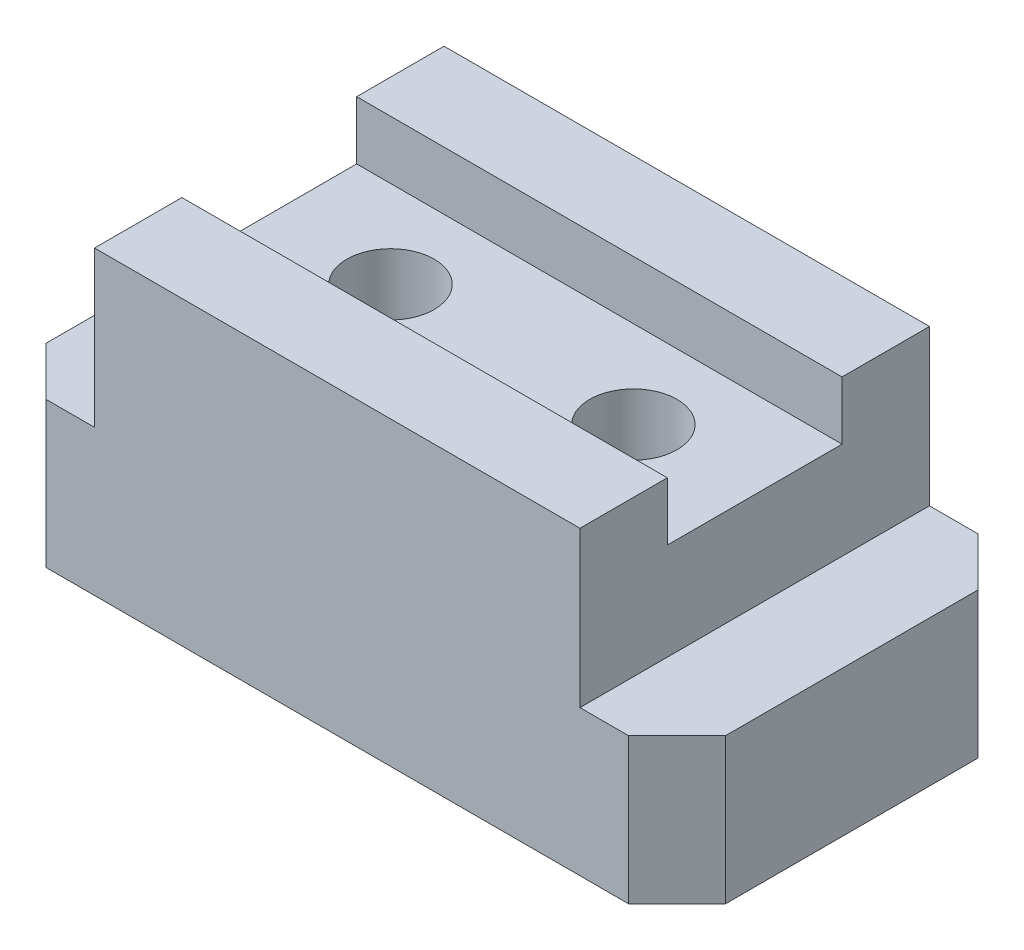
ISO-10303-21;
HEADER;
FILE_DESCRIPTION(('STEP AP214'),'2;1');
FILE_NAME('part.step','',(''),(''),'','','');
FILE_SCHEMA(('AUTOMOTIVE_DESIGN { 1 0 10303 214 1 1 1 1 }'));
ENDSEC;
DATA;
#1=APPLICATION_CONTEXT('core data for automotive mechanical design processes');
#2=APPLICATION_PROTOCOL_DEFINITION('international standard','automotive_design',2000,#1);
#3=PRODUCT_CONTEXT('',#1,'mechanical');
#4=PRODUCT('Part','Part','',(#3));
#5=PRODUCT_RELATED_PRODUCT_CATEGORY('part','',(#4));
#6=PRODUCT_DEFINITION_FORMATION('','',#4);
#7=PRODUCT_DEFINITION_CONTEXT('part definition',#1,'design');
#8=PRODUCT_DEFINITION('design','',#6,#7);
#9=PRODUCT_DEFINITION_SHAPE('','',#8);
#10=(LENGTH_UNIT() NAMED_UNIT(*) SI_UNIT(.MILLI.,.METRE.));
#11=(NAMED_UNIT(*) PLANE_ANGLE_UNIT() SI_UNIT($,.RADIAN.));
#12=(NAMED_UNIT(*) SI_UNIT($,.STERADIAN.) SOLID_ANGLE_UNIT());
#13=UNCERTAINTY_MEASURE_WITH_UNIT(LENGTH_MEASURE(1.E-05),#10,'distance_accuracy_value','');
#14=(GEOMETRIC_REPRESENTATION_CONTEXT(3) GLOBAL_UNCERTAINTY_ASSIGNED_CONTEXT((#13)) GLOBAL_UNIT_ASSIGNED_CONTEXT((#10,
#11,#12)) REPRESENTATION_CONTEXT('',''));
#15=CARTESIAN_POINT('',(0.,0.,0.));
#16=DIRECTION('',(0.,0.,1.));
#17=DIRECTION('',(1.,0.,0.));
#18=AXIS2_PLACEMENT_3D('',#15,#16,#17);
#19=CARTESIAN_POINT('',(10.,31.,-36.));
#20=DIRECTION('',(0.,1.,0.));
#21=DIRECTION('',(0.,0.,1.));
#22=AXIS2_PLACEMENT_3D('',#19,#20,#21);
#23=PLANE('',#22);
#24=DIRECTION('',(1.,0.,0.));
#25=VECTOR('',#24,1.);
#26=CARTESIAN_POINT('',(10.,31.,-9.));
#27=LINE('',#26,#25);
#28=CARTESIAN_POINT('',(10.,31.,-9.));
#29=VERTEX_POINT('',#28);
#30=CARTESIAN_POINT('',(60.,31.,-9.));
#31=VERTEX_POINT('',#30);
#32=EDGE_CURVE('E175',#29,#31,#27,.T.);
#33=ORIENTED_EDGE('',*,*,#32,.F.);
#34=DIRECTION('',(0.,0.,1.));
#35=VECTOR('',#34,1.);
#36=CARTESIAN_POINT('',(10.,31.,-36.));
#37=LINE('',#36,#35);
#38=CARTESIAN_POINT('',(10.,31.,0.));
#39=VERTEX_POINT('',#38);
#40=EDGE_CURVE('E201',#29,#39,#37,.T.);
#41=ORIENTED_EDGE('',*,*,#40,.T.);
#42=DIRECTION('',(-1.,0.,0.));
#43=VECTOR('',#42,1.);
#44=CARTESIAN_POINT('',(10.,31.,0.));
#45=LINE('',#44,#43);
#46=CARTESIAN_POINT('',(60.,31.,0.));
#47=VERTEX_POINT('',#46);
#48=EDGE_CURVE('E226',#47,#39,#45,.T.);
#49=ORIENTED_EDGE('',*,*,#48,.F.);
#50=DIRECTION('',(0.,0.,1.));
#51=VECTOR('',#50,1.);
#52=CARTESIAN_POINT('',(60.,31.,-36.));
#53=LINE('',#52,#51);
#54=EDGE_CURVE('E196',#31,#47,#53,.T.);
#55=ORIENTED_EDGE('',*,*,#54,.F.);
#56=EDGE_LOOP('',(#33,#41,#49,#55));
#57=FACE_BOUND('',#56,.T.);
#58=ADVANCED_FACE('F26',(#57),#23,.T.);
#59=CARTESIAN_POINT('',(70.,0.,-36.));
#60=DIRECTION('',(0.,-1.,0.));
#61=DIRECTION('',(1.,0.,0.));
#62=AXIS2_PLACEMENT_3D('',#59,#60,#61);
#63=PLANE('',#62);
#64=CARTESIAN_POINT('',(47.5,0.,-18.));
#65=DIRECTION('',(0.,-1.,0.));
#66=DIRECTION('',(1.,0.,0.));
#67=AXIS2_PLACEMENT_3D('',#64,#65,#66);
#68=CIRCLE('',#67,7.5);
#69=CARTESIAN_POINT('',(55.,0.,-18.));
#70=VERTEX_POINT('',#69);
#71=EDGE_CURVE('E239',#70,#70,#68,.T.);
#72=ORIENTED_EDGE('',*,*,#71,.F.);
#73=EDGE_LOOP('',(#72));
#74=FACE_BOUND('',#73,.T.);
#75=CARTESIAN_POINT('',(22.5,0.,-18.));
#76=DIRECTION('',(0.,-1.,0.));
#77=DIRECTION('',(1.,0.,0.));
#78=AXIS2_PLACEMENT_3D('',#75,#76,#77);
#79=CIRCLE('',#78,7.5);
#80=CARTESIAN_POINT('',(30.,0.,-18.));
#81=VERTEX_POINT('',#80);
#82=EDGE_CURVE('E222',#81,#81,#79,.T.);
#83=ORIENTED_EDGE('',*,*,#82,.F.);
#84=EDGE_LOOP('',(#83));
#85=FACE_BOUND('',#84,.T.);
#86=DIRECTION('',(0.,0.,1.));
#87=VECTOR('',#86,1.);
#88=CARTESIAN_POINT('',(70.,0.,-36.));
#89=LINE('',#88,#87);
#90=CARTESIAN_POINT('',(70.,0.,-30.9999999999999));
#91=VERTEX_POINT('',#90);
#92=CARTESIAN_POINT('',(70.,0.,-5.00000000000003));
#93=VERTEX_POINT('',#92);
#94=EDGE_CURVE('E183',#91,#93,#89,.T.);
#95=ORIENTED_EDGE('',*,*,#94,.T.);
#96=DIRECTION('',(0.707106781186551,0.,-0.707106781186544));
#97=VECTOR('',#96,1.);
#98=CARTESIAN_POINT('',(85.5,0.,-20.4999999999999));
#99=LINE('',#98,#97);
#100=CARTESIAN_POINT('',(64.9999999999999,0.,0.));
#101=VERTEX_POINT('',#100);
#102=EDGE_CURVE('E275',#93,#101,#99,.F.);
#103=ORIENTED_EDGE('',*,*,#102,.T.);
#104=DIRECTION('',(1.,0.,0.));
#105=VECTOR('',#104,1.);
#106=CARTESIAN_POINT('',(70.,0.,0.));
#107=LINE('',#106,#105);
#108=CARTESIAN_POINT('',(5.00000000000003,0.,0.));
#109=VERTEX_POINT('',#108);
#110=EDGE_CURVE('E190',#109,#101,#107,.T.);
#111=ORIENTED_EDGE('',*,*,#110,.F.);
#112=DIRECTION('',(0.707106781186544,0.,0.707106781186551));
#113=VECTOR('',#112,1.);
#114=CARTESIAN_POINT('',(19.4999999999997,0.,14.4999999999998));
#115=LINE('',#114,#113);
#116=CARTESIAN_POINT('',(0.,0.,-5.00000000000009));
#117=VERTEX_POINT('',#116);
#118=EDGE_CURVE('E271',#109,#117,#115,.F.);
#119=ORIENTED_EDGE('',*,*,#118,.T.);
#120=DIRECTION('',(0.,0.,1.));
#121=VECTOR('',#120,1.);
#122=CARTESIAN_POINT('',(0.,0.,-36.));
#123=LINE('',#122,#121);
#124=CARTESIAN_POINT('',(0.,0.,-30.9999999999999));
#125=VERTEX_POINT('',#124);
#126=EDGE_CURVE('E186',#125,#117,#123,.T.);
#127=ORIENTED_EDGE('',*,*,#126,.F.);
#128=DIRECTION('',(0.707106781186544,0.,-0.707106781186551));
#129=VECTOR('',#128,1.);
#130=CARTESIAN_POINT('',(37.4999999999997,0.,-68.5));
#131=LINE('',#130,#129);
#132=CARTESIAN_POINT('',(5.00000000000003,0.,-36.));
#133=VERTEX_POINT('',#132);
#134=EDGE_CURVE('E269',#125,#133,#131,.T.);
#135=ORIENTED_EDGE('',*,*,#134,.T.);
#136=DIRECTION('',(1.,0.,0.));
#137=VECTOR('',#136,1.);
#138=CARTESIAN_POINT('',(70.,0.,-36.));
#139=LINE('',#138,#137);
#140=CARTESIAN_POINT('',(65.,0.,-36.));
#141=VERTEX_POINT('',#140);
#142=EDGE_CURVE('E182',#133,#141,#139,.T.);
#143=ORIENTED_EDGE('',*,*,#142,.T.);
#144=DIRECTION('',(0.707106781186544,0.,0.707106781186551));
#145=VECTOR('',#144,1.);
#146=CARTESIAN_POINT('',(67.5,0.,-33.5));
#147=LINE('',#146,#145);
#148=EDGE_CURVE('E273',#141,#91,#147,.T.);
#149=ORIENTED_EDGE('',*,*,#148,.T.);
#150=EDGE_LOOP('',(#95,#103,#111,#119,#127,#135,#143,#149));
#151=FACE_BOUND('',#150,.T.);
#152=ADVANCED_FACE('F289',(#74,#85,#151),#63,.T.);
#153=CARTESIAN_POINT('',(0.,0.,-36.));
#154=DIRECTION('',(-1.,0.,0.));
#155=DIRECTION('',(0.,0.,1.));
#156=AXIS2_PLACEMENT_3D('',#153,#154,#155);
#157=PLANE('',#156);
#158=ORIENTED_EDGE('',*,*,#126,.T.);
#159=DIRECTION('',(0.,1.,0.));
#160=VECTOR('',#159,1.);
#161=CARTESIAN_POINT('',(0.,0.,-5.00000000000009));
#162=LINE('',#161,#160);
#163=CARTESIAN_POINT('',(0.,15.,-5.00000000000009));
#164=VERTEX_POINT('',#163);
#165=EDGE_CURVE('E41',#117,#164,#162,.T.);
#166=ORIENTED_EDGE('',*,*,#165,.T.);
#167=DIRECTION('',(0.,0.,1.));
#168=VECTOR('',#167,1.);
#169=CARTESIAN_POINT('',(0.,15.,-36.));
#170=LINE('',#169,#168);
#171=CARTESIAN_POINT('',(0.,15.,-30.9999999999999));
#172=VERTEX_POINT('',#171);
#173=EDGE_CURVE('E206',#172,#164,#170,.T.);
#174=ORIENTED_EDGE('',*,*,#173,.F.);
#175=DIRECTION('',(0.,-1.,0.));
#176=VECTOR('',#175,1.);
#177=CARTESIAN_POINT('',(0.,0.,-30.9999999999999));
#178=LINE('',#177,#176);
#179=EDGE_CURVE('E281',#172,#125,#178,.T.);
#180=ORIENTED_EDGE('',*,*,#179,.T.);
#181=EDGE_LOOP('',(#158,#166,#174,#180));
#182=FACE_BOUND('',#181,.T.);
#183=ADVANCED_FACE('F286',(#182),#157,.T.);
#184=CARTESIAN_POINT('',(0.,15.,-36.));
#185=DIRECTION('',(0.,1.,0.));
#186=DIRECTION('',(0.,0.,1.));
#187=AXIS2_PLACEMENT_3D('',#184,#185,#186);
#188=PLANE('',#187);
#189=ORIENTED_EDGE('',*,*,#173,.T.);
#190=DIRECTION('',(-0.707106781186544,0.,-0.707106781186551));
#191=VECTOR('',#190,1.);
#192=CARTESIAN_POINT('',(-15.5,15.,-20.5000000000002));
#193=LINE('',#192,#191);
#194=CARTESIAN_POINT('',(5.00000000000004,15.,0.));
#195=VERTEX_POINT('',#194);
#196=EDGE_CURVE('E11',#164,#195,#193,.F.);
#197=ORIENTED_EDGE('',*,*,#196,.T.);
#198=DIRECTION('',(-1.,0.,0.));
#199=VECTOR('',#198,1.);
#200=CARTESIAN_POINT('',(0.,15.,0.));
#201=LINE('',#200,#199);
#202=CARTESIAN_POINT('',(10.,15.,0.));
#203=VERTEX_POINT('',#202);
#204=EDGE_CURVE('E219',#203,#195,#201,.T.);
#205=ORIENTED_EDGE('',*,*,#204,.F.);
#206=DIRECTION('',(0.,0.,1.));
#207=VECTOR('',#206,1.);
#208=CARTESIAN_POINT('',(10.,15.,-36.));
#209=LINE('',#208,#207);
#210=CARTESIAN_POINT('',(10.,15.,-36.));
#211=VERTEX_POINT('',#210);
#212=EDGE_CURVE('E202',#211,#203,#209,.T.);
#213=ORIENTED_EDGE('',*,*,#212,.F.);
#214=DIRECTION('',(-1.,0.,0.));
#215=VECTOR('',#214,1.);
#216=CARTESIAN_POINT('',(0.,15.,-36.));
#217=LINE('',#216,#215);
#218=CARTESIAN_POINT('',(5.00000000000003,15.,-36.));
#219=VERTEX_POINT('',#218);
#220=EDGE_CURVE('E208',#211,#219,#217,.T.);
#221=ORIENTED_EDGE('',*,*,#220,.T.);
#222=DIRECTION('',(-0.707106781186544,0.,0.707106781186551));
#223=VECTOR('',#222,1.);
#224=CARTESIAN_POINT('',(2.50000000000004,15.,-33.5));
#225=LINE('',#224,#223);
#226=EDGE_CURVE('E34',#219,#172,#225,.T.);
#227=ORIENTED_EDGE('',*,*,#226,.T.);
#228=EDGE_LOOP('',(#189,#197,#205,#213,#221,#227));
#229=FACE_BOUND('',#228,.T.);
#230=ADVANCED_FACE('F301',(#229),#188,.T.);
#231=CARTESIAN_POINT('',(10.,15.,-36.));
#232=DIRECTION('',(-1.,0.,0.));
#233=DIRECTION('',(0.,0.,1.));
#234=AXIS2_PLACEMENT_3D('',#231,#232,#233);
#235=PLANE('',#234);
#236=DIRECTION('',(0.,1.,0.));
#237=VECTOR('',#236,1.);
#238=CARTESIAN_POINT('',(10.,15.,-9.));
#239=LINE('',#238,#237);
#240=CARTESIAN_POINT('',(10.,25.,-9.));
#241=VERTEX_POINT('',#240);
#242=EDGE_CURVE('E177',#241,#29,#239,.T.);
#243=ORIENTED_EDGE('',*,*,#242,.F.);
#244=DIRECTION('',(0.,0.,1.));
#245=VECTOR('',#244,1.);
#246=CARTESIAN_POINT('',(10.,25.,-36.));
#247=LINE('',#246,#245);
#248=CARTESIAN_POINT('',(10.,25.,-27.));
#249=VERTEX_POINT('',#248);
#250=EDGE_CURVE('E170',#249,#241,#247,.T.);
#251=ORIENTED_EDGE('',*,*,#250,.F.);
#252=DIRECTION('',(0.,-1.,0.));
#253=VECTOR('',#252,1.);
#254=CARTESIAN_POINT('',(10.,15.,-27.));
#255=LINE('',#254,#253);
#256=CARTESIAN_POINT('',(10.,31.,-27.));
#257=VERTEX_POINT('',#256);
#258=EDGE_CURVE('E145',#257,#249,#255,.T.);
#259=ORIENTED_EDGE('',*,*,#258,.F.);
#260=CARTESIAN_POINT('',(10.,31.,-36.));
#261=VERTEX_POINT('',#260);
#262=EDGE_CURVE('E197',#261,#257,#37,.T.);
#263=ORIENTED_EDGE('',*,*,#262,.F.);
#264=DIRECTION('',(0.,-1.,0.));
#265=VECTOR('',#264,1.);
#266=CARTESIAN_POINT('',(10.,15.,-36.));
#267=LINE('',#266,#265);
#268=EDGE_CURVE('E205',#261,#211,#267,.T.);
#269=ORIENTED_EDGE('',*,*,#268,.T.);
#270=ORIENTED_EDGE('',*,*,#212,.T.);
#271=DIRECTION('',(0.,-1.,0.));
#272=VECTOR('',#271,1.);
#273=CARTESIAN_POINT('',(10.,15.,0.));
#274=LINE('',#273,#272);
#275=EDGE_CURVE('E223',#39,#203,#274,.T.);
#276=ORIENTED_EDGE('',*,*,#275,.F.);
#277=ORIENTED_EDGE('',*,*,#40,.F.);
#278=EDGE_LOOP('',(#243,#251,#259,#263,#269,#270,#276,#277));
#279=FACE_BOUND('',#278,.T.);
#280=ADVANCED_FACE('F311',(#279),#235,.T.);
#281=DIRECTION('',(-1.,0.,0.));
#282=VECTOR('',#281,1.);
#283=CARTESIAN_POINT('',(10.,31.,-27.));
#284=LINE('',#283,#282);
#285=CARTESIAN_POINT('',(60.,31.,-27.));
#286=VERTEX_POINT('',#285);
#287=EDGE_CURVE('E172',#286,#257,#284,.T.);
#288=ORIENTED_EDGE('',*,*,#287,.F.);
#289=CARTESIAN_POINT('',(60.,31.,-36.));
#290=VERTEX_POINT('',#289);
#291=EDGE_CURVE('E163',#290,#286,#53,.T.);
#292=ORIENTED_EDGE('',*,*,#291,.F.);
#293=DIRECTION('',(-1.,0.,0.));
#294=VECTOR('',#293,1.);
#295=CARTESIAN_POINT('',(10.,31.,-36.));
#296=LINE('',#295,#294);
#297=EDGE_CURVE('E204',#290,#261,#296,.T.);
#298=ORIENTED_EDGE('',*,*,#297,.T.);
#299=ORIENTED_EDGE('',*,*,#262,.T.);
#300=EDGE_LOOP('',(#288,#292,#298,#299));
#301=FACE_BOUND('',#300,.T.);
#302=ADVANCED_FACE('F28',(#301),#23,.T.);
#303=CARTESIAN_POINT('',(60.,31.,-36.));
#304=DIRECTION('',(1.,0.,0.));
#305=DIRECTION('',(0.,1.,0.));
#306=AXIS2_PLACEMENT_3D('',#303,#304,#305);
#307=PLANE('',#306);
#308=DIRECTION('',(0.,-1.,0.));
#309=VECTOR('',#308,1.);
#310=CARTESIAN_POINT('',(60.,31.,-9.));
#311=LINE('',#310,#309);
#312=CARTESIAN_POINT('',(60.,25.,-9.));
#313=VERTEX_POINT('',#312);
#314=EDGE_CURVE('E250',#31,#313,#311,.T.);
#315=ORIENTED_EDGE('',*,*,#314,.F.);
#316=ORIENTED_EDGE('',*,*,#54,.T.);
#317=DIRECTION('',(0.,1.,0.));
#318=VECTOR('',#317,1.);
#319=CARTESIAN_POINT('',(60.,31.,0.));
#320=LINE('',#319,#318);
#321=CARTESIAN_POINT('',(60.,15.,0.));
#322=VERTEX_POINT('',#321);
#323=EDGE_CURVE('E229',#322,#47,#320,.T.);
#324=ORIENTED_EDGE('',*,*,#323,.F.);
#325=DIRECTION('',(0.,0.,1.));
#326=VECTOR('',#325,1.);
#327=CARTESIAN_POINT('',(60.,15.,-36.));
#328=LINE('',#327,#326);
#329=CARTESIAN_POINT('',(60.,15.,-36.));
#330=VERTEX_POINT('',#329);
#331=EDGE_CURVE('E191',#330,#322,#328,.T.);
#332=ORIENTED_EDGE('',*,*,#331,.F.);
#333=DIRECTION('',(0.,1.,0.));
#334=VECTOR('',#333,1.);
#335=CARTESIAN_POINT('',(60.,31.,-36.));
#336=LINE('',#335,#334);
#337=EDGE_CURVE('E200',#330,#290,#336,.T.);
#338=ORIENTED_EDGE('',*,*,#337,.T.);
#339=ORIENTED_EDGE('',*,*,#291,.T.);
#340=DIRECTION('',(0.,1.,0.));
#341=VECTOR('',#340,1.);
#342=CARTESIAN_POINT('',(60.,32.0164446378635,-27.));
#343=LINE('',#342,#341);
#344=CARTESIAN_POINT('',(60.,25.,-27.));
#345=VERTEX_POINT('',#344);
#346=EDGE_CURVE('E142',#345,#286,#343,.T.);
#347=ORIENTED_EDGE('',*,*,#346,.F.);
#348=DIRECTION('',(0.,0.,-1.));
#349=VECTOR('',#348,1.);
#350=CARTESIAN_POINT('',(60.,25.,-9.));
#351=LINE('',#350,#349);
#352=EDGE_CURVE('E152',#313,#345,#351,.T.);
#353=ORIENTED_EDGE('',*,*,#352,.F.);
#354=EDGE_LOOP('',(#315,#316,#324,#332,#338,#339,#347,#353));
#355=FACE_BOUND('',#354,.T.);
#356=ADVANCED_FACE('F161',(#355),#307,.T.);
#357=CARTESIAN_POINT('',(60.,15.,-36.));
#358=DIRECTION('',(0.,1.,0.));
#359=DIRECTION('',(0.,0.,1.));
#360=AXIS2_PLACEMENT_3D('',#357,#358,#359);
#361=PLANE('',#360);
#362=DIRECTION('',(-1.,0.,0.));
#363=VECTOR('',#362,1.);
#364=CARTESIAN_POINT('',(60.,15.,0.));
#365=LINE('',#364,#363);
#366=CARTESIAN_POINT('',(64.9999999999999,15.,0.));
#367=VERTEX_POINT('',#366);
#368=EDGE_CURVE('E232',#367,#322,#365,.T.);
#369=ORIENTED_EDGE('',*,*,#368,.F.);
#370=DIRECTION('',(-0.707106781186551,0.,0.707106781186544));
#371=VECTOR('',#370,1.);
#372=CARTESIAN_POINT('',(80.4999999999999,15.,-15.4999999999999));
#373=LINE('',#372,#371);
#374=CARTESIAN_POINT('',(70.,15.,-5.00000000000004));
#375=VERTEX_POINT('',#374);
#376=EDGE_CURVE('E262',#367,#375,#373,.F.);
#377=ORIENTED_EDGE('',*,*,#376,.T.);
#378=DIRECTION('',(0.,0.,1.));
#379=VECTOR('',#378,1.);
#380=CARTESIAN_POINT('',(70.,15.,-36.));
#381=LINE('',#380,#379);
#382=CARTESIAN_POINT('',(70.,15.,-30.9999999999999));
#383=VERTEX_POINT('',#382);
#384=EDGE_CURVE('E187',#383,#375,#381,.T.);
#385=ORIENTED_EDGE('',*,*,#384,.F.);
#386=DIRECTION('',(-0.707106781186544,0.,-0.707106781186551));
#387=VECTOR('',#386,1.);
#388=CARTESIAN_POINT('',(62.5,15.,-38.5));
#389=LINE('',#388,#387);
#390=CARTESIAN_POINT('',(65.,15.,-36.));
#391=VERTEX_POINT('',#390);
#392=EDGE_CURVE('E260',#383,#391,#389,.T.);
#393=ORIENTED_EDGE('',*,*,#392,.T.);
#394=DIRECTION('',(-1.,0.,0.));
#395=VECTOR('',#394,1.);
#396=CARTESIAN_POINT('',(60.,15.,-36.));
#397=LINE('',#396,#395);
#398=EDGE_CURVE('E194',#391,#330,#397,.T.);
#399=ORIENTED_EDGE('',*,*,#398,.T.);
#400=ORIENTED_EDGE('',*,*,#331,.T.);
#401=EDGE_LOOP('',(#369,#377,#385,#393,#399,#400));
#402=FACE_BOUND('',#401,.T.);
#403=ADVANCED_FACE('F318',(#402),#361,.T.);
#404=CARTESIAN_POINT('',(70.,15.,-36.));
#405=DIRECTION('',(1.,0.,0.));
#406=DIRECTION('',(0.,0.,-1.));
#407=AXIS2_PLACEMENT_3D('',#404,#405,#406);
#408=PLANE('',#407);
#409=ORIENTED_EDGE('',*,*,#384,.T.);
#410=DIRECTION('',(0.,-1.,0.));
#411=VECTOR('',#410,1.);
#412=CARTESIAN_POINT('',(70.,15.,-5.00000000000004));
#413=LINE('',#412,#411);
#414=EDGE_CURVE('E267',#375,#93,#413,.T.);
#415=ORIENTED_EDGE('',*,*,#414,.T.);
#416=ORIENTED_EDGE('',*,*,#94,.F.);
#417=DIRECTION('',(0.,1.,0.));
#418=VECTOR('',#417,1.);
#419=CARTESIAN_POINT('',(70.,15.,-30.9999999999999));
#420=LINE('',#419,#418);
#421=EDGE_CURVE('E264',#91,#383,#420,.T.);
#422=ORIENTED_EDGE('',*,*,#421,.T.);
#423=EDGE_LOOP('',(#409,#415,#416,#422));
#424=FACE_BOUND('',#423,.T.);
#425=ADVANCED_FACE('F328',(#424),#408,.T.);
#426=CARTESIAN_POINT('',(70.,0.,-36.));
#427=DIRECTION('',(0.,0.,1.));
#428=DIRECTION('',(1.,0.,0.));
#429=AXIS2_PLACEMENT_3D('',#426,#427,#428);
#430=PLANE('',#429);
#431=ORIENTED_EDGE('',*,*,#398,.F.);
#432=DIRECTION('',(0.,-1.,0.));
#433=VECTOR('',#432,1.);
#434=CARTESIAN_POINT('',(65.,0.,-36.));
#435=LINE('',#434,#433);
#436=EDGE_CURVE('E279',#391,#141,#435,.T.);
#437=ORIENTED_EDGE('',*,*,#436,.T.);
#438=ORIENTED_EDGE('',*,*,#142,.F.);
#439=DIRECTION('',(0.,1.,0.));
#440=VECTOR('',#439,1.);
#441=CARTESIAN_POINT('',(5.00000000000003,15.,-36.));
#442=LINE('',#441,#440);
#443=EDGE_CURVE('E277',#133,#219,#442,.T.);
#444=ORIENTED_EDGE('',*,*,#443,.T.);
#445=ORIENTED_EDGE('',*,*,#220,.F.);
#446=ORIENTED_EDGE('',*,*,#268,.F.);
#447=ORIENTED_EDGE('',*,*,#297,.F.);
#448=ORIENTED_EDGE('',*,*,#337,.F.);
#449=EDGE_LOOP('',(#431,#437,#438,#444,#445,#446,#447,#448));
#450=FACE_BOUND('',#449,.T.);
#451=ADVANCED_FACE('F307',(#450),#430,.F.);
#452=CARTESIAN_POINT('',(70.,0.,0.));
#453=DIRECTION('',(0.,0.,1.));
#454=DIRECTION('',(1.,0.,0.));
#455=AXIS2_PLACEMENT_3D('',#452,#453,#454);
#456=PLANE('',#455);
#457=ORIENTED_EDGE('',*,*,#110,.T.);
#458=DIRECTION('',(0.,1.,0.));
#459=VECTOR('',#458,1.);
#460=CARTESIAN_POINT('',(64.9999999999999,0.,0.));
#461=LINE('',#460,#459);
#462=EDGE_CURVE('E257',#101,#367,#461,.T.);
#463=ORIENTED_EDGE('',*,*,#462,.T.);
#464=ORIENTED_EDGE('',*,*,#368,.T.);
#465=ORIENTED_EDGE('',*,*,#323,.T.);
#466=ORIENTED_EDGE('',*,*,#48,.T.);
#467=ORIENTED_EDGE('',*,*,#275,.T.);
#468=ORIENTED_EDGE('',*,*,#204,.T.);
#469=DIRECTION('',(0.,-1.,0.));
#470=VECTOR('',#469,1.);
#471=CARTESIAN_POINT('',(5.00000000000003,0.,0.));
#472=LINE('',#471,#470);
#473=EDGE_CURVE('E254',#195,#109,#472,.T.);
#474=ORIENTED_EDGE('',*,*,#473,.T.);
#475=EDGE_LOOP('',(#457,#463,#464,#465,#466,#467,#468,#474));
#476=FACE_BOUND('',#475,.T.);
#477=ADVANCED_FACE('F297',(#476),#456,.T.);
#478=CARTESIAN_POINT('',(22.5,10.,-18.));
#479=DIRECTION('',(0.,-1.,0.));
#480=DIRECTION('',(1.,0.,0.));
#481=AXIS2_PLACEMENT_3D('',#478,#479,#480);
#482=CYLINDRICAL_SURFACE('',#481,7.5);
#483=CARTESIAN_POINT('',(22.5,10.,-18.));
#484=DIRECTION('',(0.,-1.,0.));
#485=DIRECTION('',(1.,0.,0.));
#486=AXIS2_PLACEMENT_3D('',#483,#484,#485);
#487=CIRCLE('',#486,7.5);
#488=CARTESIAN_POINT('',(30.,10.,-18.));
#489=VERTEX_POINT('',#488);
#490=EDGE_CURVE('E236',#489,#489,#487,.T.);
#491=ORIENTED_EDGE('',*,*,#490,.F.);
#492=EDGE_LOOP('',(#491));
#493=FACE_BOUND('',#492,.T.);
#494=ORIENTED_EDGE('',*,*,#82,.T.);
#495=EDGE_LOOP('',(#494));
#496=FACE_BOUND('',#495,.T.);
#497=ADVANCED_FACE('F375',(#493,#496),#482,.F.);
#498=CARTESIAN_POINT('',(22.5,10.,-18.));
#499=DIRECTION('',(0.,-1.,0.));
#500=DIRECTION('',(1.,0.,0.));
#501=AXIS2_PLACEMENT_3D('',#498,#499,#500);
#502=PLANE('',#501);
#503=CARTESIAN_POINT('',(22.4845869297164,10.,-18.));
#504=DIRECTION('',(0.,-1.,0.));
#505=DIRECTION('',(1.,0.,0.));
#506=AXIS2_PLACEMENT_3D('',#503,#504,#505);
#507=CIRCLE('',#506,4.5);
#508=CARTESIAN_POINT('',(26.9845869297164,10.,-18.));
#509=VERTEX_POINT('',#508);
#510=EDGE_CURVE('E245',#509,#509,#507,.T.);
#511=ORIENTED_EDGE('',*,*,#510,.F.);
#512=EDGE_LOOP('',(#511));
#513=FACE_BOUND('',#512,.T.);
#514=ORIENTED_EDGE('',*,*,#490,.T.);
#515=EDGE_LOOP('',(#514));
#516=FACE_BOUND('',#515,.T.);
#517=ADVANCED_FACE('F378',(#513,#516),#502,.T.);
#518=CARTESIAN_POINT('',(47.5,10.,-18.));
#519=DIRECTION('',(0.,-1.,0.));
#520=DIRECTION('',(1.,0.,0.));
#521=AXIS2_PLACEMENT_3D('',#518,#519,#520);
#522=CYLINDRICAL_SURFACE('',#521,7.5);
#523=CARTESIAN_POINT('',(47.5,10.,-18.));
#524=DIRECTION('',(0.,-1.,0.));
#525=DIRECTION('',(1.,0.,0.));
#526=AXIS2_PLACEMENT_3D('',#523,#524,#525);
#527=CIRCLE('',#526,7.5);
#528=CARTESIAN_POINT('',(55.,10.,-18.));
#529=VERTEX_POINT('',#528);
#530=EDGE_CURVE('E242',#529,#529,#527,.T.);
#531=ORIENTED_EDGE('',*,*,#530,.F.);
#532=EDGE_LOOP('',(#531));
#533=FACE_BOUND('',#532,.T.);
#534=ORIENTED_EDGE('',*,*,#71,.T.);
#535=EDGE_LOOP('',(#534));
#536=FACE_BOUND('',#535,.T.);
#537=ADVANCED_FACE('F380',(#533,#536),#522,.F.);
#538=CARTESIAN_POINT('',(47.5,10.,-18.));
#539=DIRECTION('',(0.,-1.,0.));
#540=DIRECTION('',(1.,0.,0.));
#541=AXIS2_PLACEMENT_3D('',#538,#539,#540);
#542=PLANE('',#541);
#543=CARTESIAN_POINT('',(47.5,10.,-18.));
#544=DIRECTION('',(0.,-1.,0.));
#545=DIRECTION('',(1.,0.,0.));
#546=AXIS2_PLACEMENT_3D('',#543,#544,#545);
#547=CIRCLE('',#546,4.5);
#548=CARTESIAN_POINT('',(52.,10.,-18.));
#549=VERTEX_POINT('',#548);
#550=EDGE_CURVE('E179',#549,#549,#547,.T.);
#551=ORIENTED_EDGE('',*,*,#550,.F.);
#552=EDGE_LOOP('',(#551));
#553=FACE_BOUND('',#552,.T.);
#554=ORIENTED_EDGE('',*,*,#530,.T.);
#555=EDGE_LOOP('',(#554));
#556=FACE_BOUND('',#555,.T.);
#557=ADVANCED_FACE('F383',(#553,#556),#542,.T.);
#558=CARTESIAN_POINT('',(22.4845869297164,31.001,-18.));
#559=DIRECTION('',(0.,-1.,0.));
#560=DIRECTION('',(1.,0.,0.));
#561=AXIS2_PLACEMENT_3D('',#558,#559,#560);
#562=CYLINDRICAL_SURFACE('',#561,4.5);
#563=CARTESIAN_POINT('',(22.4845869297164,25.,-18.));
#564=DIRECTION('',(0.,-1.,0.));
#565=DIRECTION('',(1.,0.,0.));
#566=AXIS2_PLACEMENT_3D('',#563,#564,#565);
#567=CIRCLE('',#566,4.5);
#568=CARTESIAN_POINT('',(26.9845869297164,25.,-18.));
#569=VERTEX_POINT('',#568);
#570=EDGE_CURVE('E167',#569,#569,#567,.F.);
#571=ORIENTED_EDGE('',*,*,#570,.T.);
#572=EDGE_LOOP('',(#571));
#573=FACE_BOUND('',#572,.T.);
#574=ORIENTED_EDGE('',*,*,#510,.T.);
#575=EDGE_LOOP('',(#574));
#576=FACE_BOUND('',#575,.T.);
#577=ADVANCED_FACE('F386',(#573,#576),#562,.F.);
#578=CARTESIAN_POINT('',(47.5,31.001,-18.));
#579=DIRECTION('',(0.,-1.,0.));
#580=DIRECTION('',(1.,0.,0.));
#581=AXIS2_PLACEMENT_3D('',#578,#579,#580);
#582=CYLINDRICAL_SURFACE('',#581,4.5);
#583=CARTESIAN_POINT('',(47.5,25.,-18.));
#584=DIRECTION('',(0.,-1.,0.));
#585=DIRECTION('',(1.,0.,0.));
#586=AXIS2_PLACEMENT_3D('',#583,#584,#585);
#587=CIRCLE('',#586,4.5);
#588=CARTESIAN_POINT('',(52.,25.,-18.));
#589=VERTEX_POINT('',#588);
#590=EDGE_CURVE('E148',#589,#589,#587,.F.);
#591=ORIENTED_EDGE('',*,*,#590,.T.);
#592=EDGE_LOOP('',(#591));
#593=FACE_BOUND('',#592,.T.);
#594=ORIENTED_EDGE('',*,*,#550,.T.);
#595=EDGE_LOOP('',(#594));
#596=FACE_BOUND('',#595,.T.);
#597=ADVANCED_FACE('F346',(#593,#596),#582,.F.);
#598=CARTESIAN_POINT('',(0.,25.,-9.));
#599=DIRECTION('',(0.,-1.,0.));
#600=DIRECTION('',(1.,0.,0.));
#601=AXIS2_PLACEMENT_3D('',#598,#599,#600);
#602=PLANE('',#601);
#603=ORIENTED_EDGE('',*,*,#250,.T.);
#604=DIRECTION('',(1.,0.,0.));
#605=VECTOR('',#604,1.);
#606=CARTESIAN_POINT('',(0.,25.,-9.));
#607=LINE('',#606,#605);
#608=EDGE_CURVE('E149',#241,#313,#607,.T.);
#609=ORIENTED_EDGE('',*,*,#608,.T.);
#610=ORIENTED_EDGE('',*,*,#352,.T.);
#611=DIRECTION('',(1.,0.,0.));
#612=VECTOR('',#611,1.);
#613=CARTESIAN_POINT('',(0.,25.,-27.));
#614=LINE('',#613,#612);
#615=EDGE_CURVE('E138',#249,#345,#614,.T.);
#616=ORIENTED_EDGE('',*,*,#615,.F.);
#617=EDGE_LOOP('',(#603,#609,#610,#616));
#618=FACE_BOUND('',#617,.T.);
#619=ORIENTED_EDGE('',*,*,#590,.F.);
#620=EDGE_LOOP('',(#619));
#621=FACE_BOUND('',#620,.T.);
#622=ORIENTED_EDGE('',*,*,#570,.F.);
#623=EDGE_LOOP('',(#622));
#624=FACE_BOUND('',#623,.T.);
#625=ADVANCED_FACE('F153',(#618,#621,#624),#602,.F.);
#626=CARTESIAN_POINT('',(0.,32.0164446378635,-9.));
#627=DIRECTION('',(0.,0.,1.));
#628=DIRECTION('',(0.,-1.,0.));
#629=AXIS2_PLACEMENT_3D('',#626,#627,#628);
#630=PLANE('',#629);
#631=ORIENTED_EDGE('',*,*,#242,.T.);
#632=ORIENTED_EDGE('',*,*,#32,.T.);
#633=ORIENTED_EDGE('',*,*,#314,.T.);
#634=ORIENTED_EDGE('',*,*,#608,.F.);
#635=EDGE_LOOP('',(#631,#632,#633,#634));
#636=FACE_BOUND('',#635,.T.);
#637=ADVANCED_FACE('F338',(#636),#630,.F.);
#638=CARTESIAN_POINT('',(0.,32.0164446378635,-27.));
#639=DIRECTION('',(0.,0.,-1.));
#640=DIRECTION('',(-1.,0.,0.));
#641=AXIS2_PLACEMENT_3D('',#638,#639,#640);
#642=PLANE('',#641);
#643=ORIENTED_EDGE('',*,*,#258,.T.);
#644=ORIENTED_EDGE('',*,*,#615,.T.);
#645=ORIENTED_EDGE('',*,*,#346,.T.);
#646=ORIENTED_EDGE('',*,*,#287,.T.);
#647=EDGE_LOOP('',(#643,#644,#645,#646));
#648=FACE_BOUND('',#647,.T.);
#649=ADVANCED_FACE('F140',(#648),#642,.F.);
#650=CARTESIAN_POINT('',(64.9999999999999,0.,0.));
#651=DIRECTION('',(-0.707106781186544,0.,-0.707106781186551));
#652=DIRECTION('',(-0.707106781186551,0.,0.707106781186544));
#653=AXIS2_PLACEMENT_3D('',#650,#651,#652);
#654=PLANE('',#653);
#655=ORIENTED_EDGE('',*,*,#102,.F.);
#656=ORIENTED_EDGE('',*,*,#414,.F.);
#657=ORIENTED_EDGE('',*,*,#376,.F.);
#658=ORIENTED_EDGE('',*,*,#462,.F.);
#659=EDGE_LOOP('',(#655,#656,#657,#658));
#660=FACE_BOUND('',#659,.T.);
#661=ADVANCED_FACE('F331',(#660),#654,.F.);
#662=CARTESIAN_POINT('',(70.,15.,-30.9999999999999));
#663=DIRECTION('',(0.707106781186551,0.,-0.707106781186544));
#664=DIRECTION('',(-0.707106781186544,0.,-0.707106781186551));
#665=AXIS2_PLACEMENT_3D('',#662,#663,#664);
#666=PLANE('',#665);
#667=ORIENTED_EDGE('',*,*,#148,.F.);
#668=ORIENTED_EDGE('',*,*,#436,.F.);
#669=ORIENTED_EDGE('',*,*,#392,.F.);
#670=ORIENTED_EDGE('',*,*,#421,.F.);
#671=EDGE_LOOP('',(#667,#668,#669,#670));
#672=FACE_BOUND('',#671,.T.);
#673=ADVANCED_FACE('F323',(#672),#666,.T.);
#674=CARTESIAN_POINT('',(5.00000000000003,0.,0.));
#675=DIRECTION('',(0.707106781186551,0.,-0.707106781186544));
#676=DIRECTION('',(-0.707106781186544,0.,-0.707106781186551));
#677=AXIS2_PLACEMENT_3D('',#674,#675,#676);
#678=PLANE('',#677);
#679=ORIENTED_EDGE('',*,*,#196,.F.);
#680=ORIENTED_EDGE('',*,*,#165,.F.);
#681=ORIENTED_EDGE('',*,*,#118,.F.);
#682=ORIENTED_EDGE('',*,*,#473,.F.);
#683=EDGE_LOOP('',(#679,#680,#681,#682));
#684=FACE_BOUND('',#683,.T.);
#685=ADVANCED_FACE('F295',(#684),#678,.F.);
#686=CARTESIAN_POINT('',(0.,0.,-30.9999999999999));
#687=DIRECTION('',(-0.707106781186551,0.,-0.707106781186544));
#688=DIRECTION('',(-0.707106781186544,0.,0.707106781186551));
#689=AXIS2_PLACEMENT_3D('',#686,#687,#688);
#690=PLANE('',#689);
#691=ORIENTED_EDGE('',*,*,#226,.F.);
#692=ORIENTED_EDGE('',*,*,#443,.F.);
#693=ORIENTED_EDGE('',*,*,#134,.F.);
#694=ORIENTED_EDGE('',*,*,#179,.F.);
#695=EDGE_LOOP('',(#691,#692,#693,#694));
#696=FACE_BOUND('',#695,.T.);
#697=ADVANCED_FACE('F452',(#696),#690,.T.);
#698=CLOSED_SHELL('',(#58,#152,#183,#230,#280,#302,#356,#403,#425,#451,#477,#497,#517,#537,#557,
#577,#597,#625,#637,#649,#661,#673,#685,#697));
#699=MANIFOLD_SOLID_BREP('B2',#698);
#700=ADVANCED_BREP_SHAPE_REPRESENTATION('',(#18,#699),#14);
#701=SHAPE_DEFINITION_REPRESENTATION(#9,#700);
ENDSEC;
END-ISO-10303-21;
